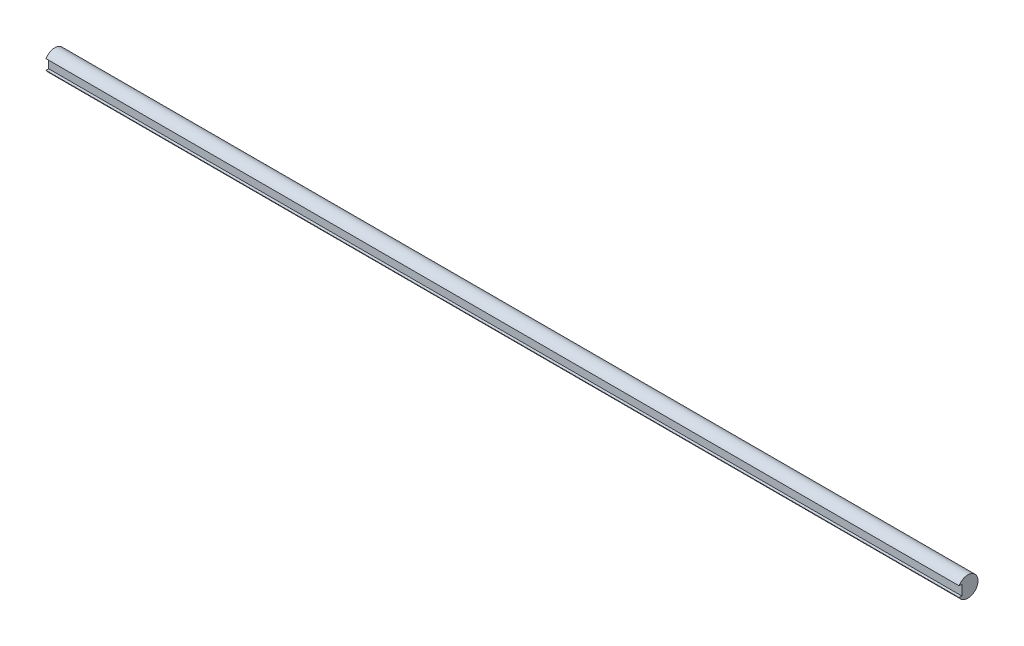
from build123d import *

# Parameters (mm, degrees)
SKETCH1_R                     = 5
MAIN_DEPTH                    = 225
FLUKE_MOUNT_CUTOUT_DEPTH      = 226.11108369
FLUKE_MOUNT_CUTOUT_DEPTH_BACK = 226.11108369
SKETCH2_W                     = 2
SKETCH2_H                     = 5


with BuildPart() as part:
    # Sketch1 → main (new, symmetric)
    with BuildSketch(Plane(origin=(0, 0, 0), x_dir=(0, 0, -1), z_dir=(1, 0, 0))):
        Circle(SKETCH1_R)
    extrude(amount=MAIN_DEPTH, both=True)

    # Sketch2 → fluke mount cutout (cut, two sides: drawn at the far end of the back side and taken through both)
    with BuildSketch(Plane(origin=(0, 0, 0), x_dir=(0, 0, -1), z_dir=(1, 0, 0)).offset(-FLUKE_MOUNT_CUTOUT_DEPTH_BACK)):
        with Locations((-4, 0)):
            Rectangle(SKETCH2_W, SKETCH2_H)
    extrude(amount=FLUKE_MOUNT_CUTOUT_DEPTH + FLUKE_MOUNT_CUTOUT_DEPTH_BACK, mode=Mode.SUBTRACT)


solid = part.part
